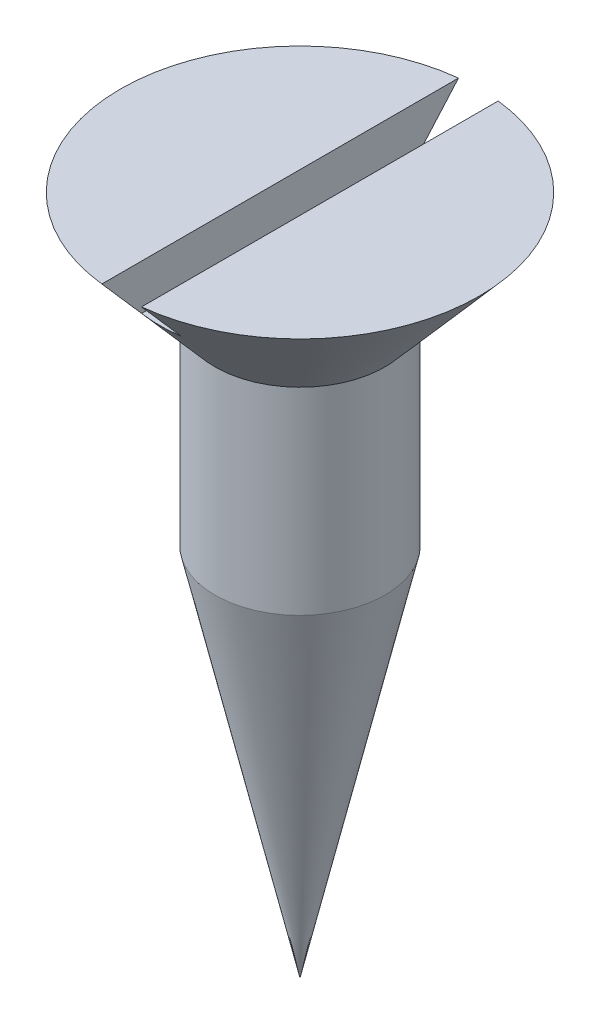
from build123d import *

# Parameters (mm, degrees)
CUT_EXTRUDE1_DEPTH      = 17.265643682
CUT_EXTRUDE1_DEPTH_BACK = 17.265643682
SKETCH2_W               = 0.889
SKETCH2_H               = 2.032


with BuildPart() as part:
    # Sketch1 → Revolve1 (revolve)
    with BuildSketch(Plane.XY):
        Polygon((0, 0), (0, -15.24), (-1.905, -6.858), (-1.905, -2.432511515), (-4.01955, 0), align=None)
    revolve(axis=Axis((0, 0, 0), (0, -1, 0)))

    # Sketch2 → Cut-Extrude1 (cut, two sides: drawn at the far end of the back side and taken through both)
    with BuildSketch(Plane.XY.offset(-CUT_EXTRUDE1_DEPTH_BACK)):
        Rectangle(SKETCH2_W, SKETCH2_H)
    extrude(amount=CUT_EXTRUDE1_DEPTH + CUT_EXTRUDE1_DEPTH_BACK, mode=Mode.SUBTRACT)


solid = part.part
